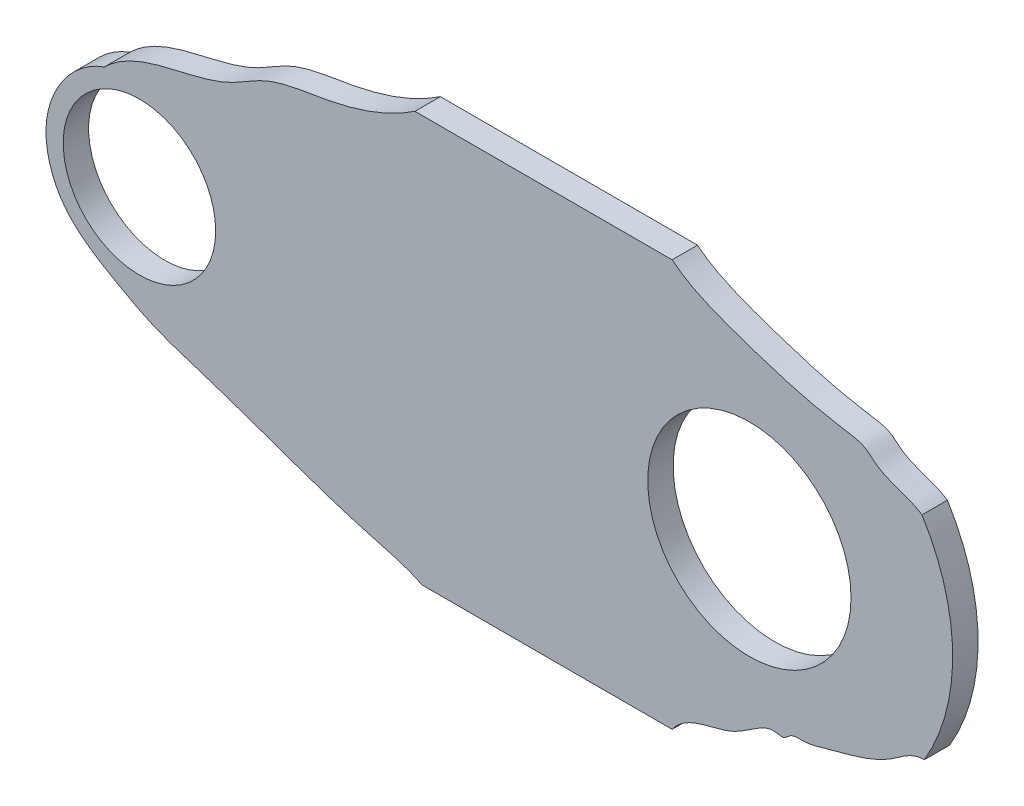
ISO-10303-21;
HEADER;
FILE_DESCRIPTION(('STEP AP214'),'2;1');
FILE_NAME('part.step','',(''),(''),'','','');
FILE_SCHEMA(('AUTOMOTIVE_DESIGN { 1 0 10303 214 1 1 1 1 }'));
ENDSEC;
DATA;
#1=APPLICATION_CONTEXT('core data for automotive mechanical design processes');
#2=APPLICATION_PROTOCOL_DEFINITION('international standard','automotive_design',2000,#1);
#3=PRODUCT_CONTEXT('',#1,'mechanical');
#4=PRODUCT('Part','Part','',(#3));
#5=PRODUCT_RELATED_PRODUCT_CATEGORY('part','',(#4));
#6=PRODUCT_DEFINITION_FORMATION('','',#4);
#7=PRODUCT_DEFINITION_CONTEXT('part definition',#1,'design');
#8=PRODUCT_DEFINITION('design','',#6,#7);
#9=PRODUCT_DEFINITION_SHAPE('','',#8);
#10=(LENGTH_UNIT() NAMED_UNIT(*) SI_UNIT(.MILLI.,.METRE.));
#11=(NAMED_UNIT(*) PLANE_ANGLE_UNIT() SI_UNIT($,.RADIAN.));
#12=(NAMED_UNIT(*) SI_UNIT($,.STERADIAN.) SOLID_ANGLE_UNIT());
#13=UNCERTAINTY_MEASURE_WITH_UNIT(LENGTH_MEASURE(1.E-05),#10,'distance_accuracy_value','');
#14=(GEOMETRIC_REPRESENTATION_CONTEXT(3) GLOBAL_UNCERTAINTY_ASSIGNED_CONTEXT((#13)) GLOBAL_UNIT_ASSIGNED_CONTEXT((#10,
#11,#12)) REPRESENTATION_CONTEXT('',''));
#15=CARTESIAN_POINT('',(0.,0.,0.));
#16=DIRECTION('',(0.,0.,1.));
#17=DIRECTION('',(1.,0.,0.));
#18=AXIS2_PLACEMENT_3D('',#15,#16,#17);
#19=CARTESIAN_POINT('',(0.,-25.4,1.5875));
#20=DIRECTION('',(0.,0.,1.));
#21=DIRECTION('',(1.,0.,0.));
#22=AXIS2_PLACEMENT_3D('',#19,#20,#21);
#23=PLANE('',#22);
#24=CARTESIAN_POINT('',(76.2,-25.4,1.5875));
#25=DIRECTION('',(0.,0.,1.));
#26=DIRECTION('',(1.,0.,0.));
#27=AXIS2_PLACEMENT_3D('',#24,#25,#26);
#28=CIRCLE('',#27,12.7);
#29=CARTESIAN_POINT('',(88.9,-25.4,1.5875));
#30=VERTEX_POINT('',#29);
#31=EDGE_CURVE('E135',#30,#30,#28,.T.);
#32=ORIENTED_EDGE('',*,*,#31,.F.);
#33=EDGE_LOOP('',(#32));
#34=FACE_BOUND('',#33,.T.);
#35=CARTESIAN_POINT('',(0.,-25.4,1.5875));
#36=DIRECTION('',(0.,0.,1.));
#37=DIRECTION('',(1.,0.,0.));
#38=AXIS2_PLACEMENT_3D('',#35,#36,#37);
#39=CIRCLE('',#38,9.525);
#40=CARTESIAN_POINT('',(9.525,-25.4,1.5875));
#41=VERTEX_POINT('',#40);
#42=EDGE_CURVE('E206',#41,#41,#39,.T.);
#43=ORIENTED_EDGE('',*,*,#42,.F.);
#44=EDGE_LOOP('',(#43));
#45=FACE_BOUND('',#44,.T.);
#46=DIRECTION('',(-1.,0.,0.));
#47=VECTOR('',#46,1.);
#48=CARTESIAN_POINT('',(0.,0.,1.5875));
#49=LINE('',#48,#47);
#50=CARTESIAN_POINT('',(66.5515188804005,0.,1.5875));
#51=VERTEX_POINT('',#50);
#52=CARTESIAN_POINT('',(34.4210052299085,0.,1.5875));
#53=VERTEX_POINT('',#52);
#54=EDGE_CURVE('E11',#51,#53,#49,.T.);
#55=ORIENTED_EDGE('',*,*,#54,.T.);
#56=CARTESIAN_POINT('',(34.4210052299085,0.,1.5875));
#57=CARTESIAN_POINT('',(31.1068154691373,-2.2380209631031,1.5875));
#58=CARTESIAN_POINT('',(24.7836750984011,-4.39158035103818,1.5875));
#59=CARTESIAN_POINT('',(16.3725521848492,-5.16756692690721,1.5875));
#60=CARTESIAN_POINT('',(8.08706240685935,-11.0508764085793,1.5875));
#61=CARTESIAN_POINT('',(-0.0218652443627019,-10.2875710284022,1.5875));
#62=CARTESIAN_POINT('',(-4.37583707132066,-14.592034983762,1.5875));
#63=B_SPLINE_CURVE_WITH_KNOTS('',3,(#56,#57,#58,#59,#60,#61,#62),.UNSPECIFIED.,.F.,.F.,(4,1,1,1,
4),(0.,0.285025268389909,0.477252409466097,0.592182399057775,1.),.UNSPECIFIED.);
#64=CARTESIAN_POINT('',(-4.37583707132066,-14.592034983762,1.5875));
#65=VERTEX_POINT('',#64);
#66=EDGE_CURVE('E69',#53,#65,#63,.T.);
#67=ORIENTED_EDGE('',*,*,#66,.T.);
#68=CARTESIAN_POINT('',(-4.37583707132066,-14.592034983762,1.5875));
#69=CARTESIAN_POINT('',(-8.48846324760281,-16.0672322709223,1.5875));
#70=CARTESIAN_POINT('',(-13.1576082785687,-22.7673859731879,1.5875));
#71=CARTESIAN_POINT('',(-10.0792392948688,-32.9254218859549,1.5875));
#72=CARTESIAN_POINT('',(-3.77750954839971,-36.6878243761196,1.5875));
#73=CARTESIAN_POINT('',(1.96612383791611,-39.8241085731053,1.5875));
#74=CARTESIAN_POINT('',(9.04935275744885,-41.9679019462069,1.5875));
#75=CARTESIAN_POINT('',(17.6035855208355,-44.997428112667,1.5875));
#76=CARTESIAN_POINT('',(26.8293725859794,-48.2818714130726,1.5875));
#77=CARTESIAN_POINT('',(32.8570605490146,-49.6067735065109,1.5875));
#78=CARTESIAN_POINT('',(35.3527860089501,-50.8,1.5875));
#79=B_SPLINE_CURVE_WITH_KNOTS('',3,(#68,#69,#70,#71,#72,#73,#74,#75,#76,#77,#78),.UNSPECIFIED.,
.F.,.F.,(4,1,1,1,1,1,1,1,4),(0.,0.186565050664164,0.294462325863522,0.418873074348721,
0.489089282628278,0.577914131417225,0.735961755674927,0.881001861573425,1.),.UNSPECIFIED.);
#80=CARTESIAN_POINT('',(35.3527860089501,-50.8,1.5875));
#81=VERTEX_POINT('',#80);
#82=EDGE_CURVE('E108',#65,#81,#79,.T.);
#83=ORIENTED_EDGE('',*,*,#82,.T.);
#84=DIRECTION('',(1.,0.,0.));
#85=VECTOR('',#84,1.);
#86=CARTESIAN_POINT('',(0.,-50.8,1.5875));
#87=LINE('',#86,#85);
#88=CARTESIAN_POINT('',(66.5515188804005,-50.8,1.5875));
#89=VERTEX_POINT('',#88);
#90=EDGE_CURVE('E120',#81,#89,#87,.T.);
#91=ORIENTED_EDGE('',*,*,#90,.T.);
#92=CARTESIAN_POINT('',(66.5515188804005,-50.8,1.5875));
#93=CARTESIAN_POINT('',(68.3851115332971,-48.2066714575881,1.5875));
#94=CARTESIAN_POINT('',(72.7990147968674,-48.4343293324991,1.5875));
#95=CARTESIAN_POINT('',(76.6520455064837,-45.6695237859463,1.5875));
#96=CARTESIAN_POINT('',(78.8215397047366,-44.3414720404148,1.5875));
#97=CARTESIAN_POINT('',(80.5474617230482,-44.9271380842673,1.5875));
#98=CARTESIAN_POINT('',(81.4612805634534,-43.7424230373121,1.5875));
#99=CARTESIAN_POINT('',(83.3052014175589,-44.0107082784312,1.5875));
#100=CARTESIAN_POINT('',(85.9904693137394,-43.1695105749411,1.5875));
#101=CARTESIAN_POINT('',(89.7402935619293,-42.2795737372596,1.5875));
#102=CARTESIAN_POINT('',(94.0483858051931,-40.5986973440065,1.5875));
#103=CARTESIAN_POINT('',(96.4612150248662,-38.3130740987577,1.5875));
#104=CARTESIAN_POINT('',(98.0566037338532,-38.3402037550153,1.5875));
#105=B_SPLINE_CURVE_WITH_KNOTS('',3,(#92,#93,#94,#95,#96,#97,#98,#99,#100,#101,#102,#103,#104),
.UNSPECIFIED.,.F.,.F.,(4,1,1,1,1,1,1,1,1,1,4),(0.,0.243553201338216,0.339654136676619,
0.417852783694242,0.450838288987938,0.478711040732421,0.531667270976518,0.597471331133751,
0.726484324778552,0.867337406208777,1.),.UNSPECIFIED.);
#106=CARTESIAN_POINT('',(98.0566037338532,-38.3402037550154,1.5875));
#107=VERTEX_POINT('',#106);
#108=EDGE_CURVE('E155',#89,#107,#105,.T.);
#109=ORIENTED_EDGE('',*,*,#108,.T.);
#110=CARTESIAN_POINT('',(76.2,-25.4,1.5875));
#111=DIRECTION('',(0.,0.,1.));
#112=DIRECTION('',(1.,0.,0.));
#113=AXIS2_PLACEMENT_3D('',#110,#111,#112);
#114=CIRCLE('',#113,25.4);
#115=CARTESIAN_POINT('',(97.7700384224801,-11.9875638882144,1.5875));
#116=VERTEX_POINT('',#115);
#117=EDGE_CURVE('E53',#107,#116,#114,.T.);
#118=ORIENTED_EDGE('',*,*,#117,.T.);
#119=CARTESIAN_POINT('',(66.5515188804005,0.,1.5875));
#120=CARTESIAN_POINT('',(68.2190463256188,-1.38420408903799,1.5875));
#121=CARTESIAN_POINT('',(71.7163860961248,-2.98038839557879,1.5875));
#122=CARTESIAN_POINT('',(77.3465555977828,-4.92336578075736,1.5875));
#123=CARTESIAN_POINT('',(82.6280367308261,-6.58165198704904,1.5875));
#124=CARTESIAN_POINT('',(87.2572940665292,-7.50686665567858,1.5875));
#125=CARTESIAN_POINT('',(90.4529661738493,-7.93062981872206,1.5875));
#126=CARTESIAN_POINT('',(93.0567702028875,-10.5140068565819,1.5875));
#127=CARTESIAN_POINT('',(95.9890772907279,-10.7827731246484,1.5875));
#128=CARTESIAN_POINT('',(97.7700384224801,-11.9875638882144,1.5875));
#129=B_SPLINE_CURVE_WITH_KNOTS('',3,(#119,#120,#121,#122,#123,#124,#125,#126,#127,#128),
.UNSPECIFIED.,.F.,.F.,(4,1,1,1,1,1,1,4),(0.,0.191374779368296,0.338945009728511,
0.531514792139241,0.680444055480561,0.76641548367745,0.804102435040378,1.),.UNSPECIFIED.);
#130=EDGE_CURVE('E165',#51,#116,#129,.T.);
#131=ORIENTED_EDGE('',*,*,#130,.F.);
#132=EDGE_LOOP('',(#55,#67,#83,#91,#109,#118,#131));
#133=FACE_BOUND('',#132,.T.);
#134=ADVANCED_FACE('F44',(#34,#45,#133),#23,.T.);
#135=CARTESIAN_POINT('',(0.,-25.4,-1.5875));
#136=DIRECTION('',(0.,0.,1.));
#137=DIRECTION('',(1.,0.,0.));
#138=AXIS2_PLACEMENT_3D('',#135,#136,#137);
#139=PLANE('',#138);
#140=CARTESIAN_POINT('',(76.2,-25.4,-1.5875));
#141=DIRECTION('',(0.,0.,1.));
#142=DIRECTION('',(1.,0.,0.));
#143=AXIS2_PLACEMENT_3D('',#140,#141,#142);
#144=CIRCLE('',#143,12.7);
#145=CARTESIAN_POINT('',(88.9,-25.4,-1.5875));
#146=VERTEX_POINT('',#145);
#147=EDGE_CURVE('E131',#146,#146,#144,.T.);
#148=ORIENTED_EDGE('',*,*,#147,.T.);
#149=EDGE_LOOP('',(#148));
#150=FACE_BOUND('',#149,.T.);
#151=CARTESIAN_POINT('',(0.,-25.4,-1.5875));
#152=DIRECTION('',(0.,0.,1.));
#153=DIRECTION('',(1.,0.,0.));
#154=AXIS2_PLACEMENT_3D('',#151,#152,#153);
#155=CIRCLE('',#154,9.525);
#156=CARTESIAN_POINT('',(9.525,-25.4,-1.5875));
#157=VERTEX_POINT('',#156);
#158=EDGE_CURVE('E212',#157,#157,#155,.T.);
#159=ORIENTED_EDGE('',*,*,#158,.T.);
#160=EDGE_LOOP('',(#159));
#161=FACE_BOUND('',#160,.T.);
#162=CARTESIAN_POINT('',(34.4210052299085,0.,-1.5875));
#163=CARTESIAN_POINT('',(31.1068154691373,-2.2380209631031,-1.5875));
#164=CARTESIAN_POINT('',(24.7836750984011,-4.39158035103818,-1.5875));
#165=CARTESIAN_POINT('',(16.3725521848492,-5.16756692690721,-1.5875));
#166=CARTESIAN_POINT('',(8.08706240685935,-11.0508764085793,-1.5875));
#167=CARTESIAN_POINT('',(-0.0218652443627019,-10.2875710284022,-1.5875));
#168=CARTESIAN_POINT('',(-4.37583707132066,-14.592034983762,-1.5875));
#169=B_SPLINE_CURVE_WITH_KNOTS('',3,(#162,#163,#164,#165,#166,#167,#168),.UNSPECIFIED.,.F.,.F.,
(4,1,1,1,4),(0.,0.285025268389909,0.477252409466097,0.592182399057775,1.),.UNSPECIFIED.);
#170=CARTESIAN_POINT('',(-4.37583707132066,-14.592034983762,-1.5875));
#171=VERTEX_POINT('',#170);
#172=CARTESIAN_POINT('',(34.4210052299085,0.,-1.5875));
#173=VERTEX_POINT('',#172);
#174=EDGE_CURVE('E121',#171,#173,#169,.F.);
#175=ORIENTED_EDGE('',*,*,#174,.T.);
#176=DIRECTION('',(-1.,0.,0.));
#177=VECTOR('',#176,1.);
#178=CARTESIAN_POINT('',(0.,0.,-1.5875));
#179=LINE('',#178,#177);
#180=CARTESIAN_POINT('',(66.5515188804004,0.,-1.5875));
#181=VERTEX_POINT('',#180);
#182=EDGE_CURVE('E48',#181,#173,#179,.T.);
#183=ORIENTED_EDGE('',*,*,#182,.F.);
#184=CARTESIAN_POINT('',(66.5515188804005,0.,-1.5875));
#185=CARTESIAN_POINT('',(68.2190463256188,-1.38420408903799,-1.5875));
#186=CARTESIAN_POINT('',(71.7163860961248,-2.98038839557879,-1.5875));
#187=CARTESIAN_POINT('',(77.3465555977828,-4.92336578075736,-1.5875));
#188=CARTESIAN_POINT('',(82.6280367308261,-6.58165198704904,-1.5875));
#189=CARTESIAN_POINT('',(87.2572940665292,-7.50686665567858,-1.5875));
#190=CARTESIAN_POINT('',(90.4529661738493,-7.93062981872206,-1.5875));
#191=CARTESIAN_POINT('',(93.0567702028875,-10.5140068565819,-1.5875));
#192=CARTESIAN_POINT('',(95.9890772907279,-10.7827731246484,-1.5875));
#193=CARTESIAN_POINT('',(97.7700384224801,-11.9875638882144,-1.5875));
#194=B_SPLINE_CURVE_WITH_KNOTS('',3,(#184,#185,#186,#187,#188,#189,#190,#191,#192,#193),
.UNSPECIFIED.,.F.,.F.,(4,1,1,1,1,1,1,4),(0.,0.191374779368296,0.338945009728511,
0.531514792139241,0.680444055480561,0.76641548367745,0.804102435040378,1.),.UNSPECIFIED.);
#195=CARTESIAN_POINT('',(97.7700384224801,-11.9875638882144,-1.5875));
#196=VERTEX_POINT('',#195);
#197=EDGE_CURVE('E149',#196,#181,#194,.F.);
#198=ORIENTED_EDGE('',*,*,#197,.F.);
#199=CARTESIAN_POINT('',(76.2,-25.4,-1.5875));
#200=DIRECTION('',(0.,0.,1.));
#201=DIRECTION('',(1.,0.,0.));
#202=AXIS2_PLACEMENT_3D('',#199,#200,#201);
#203=CIRCLE('',#202,25.4);
#204=CARTESIAN_POINT('',(98.0566037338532,-38.3402037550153,-1.5875));
#205=VERTEX_POINT('',#204);
#206=EDGE_CURVE('E129',#205,#196,#203,.T.);
#207=ORIENTED_EDGE('',*,*,#206,.F.);
#208=CARTESIAN_POINT('',(66.5515188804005,-50.8,-1.5875));
#209=CARTESIAN_POINT('',(68.3851115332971,-48.2066714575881,-1.5875));
#210=CARTESIAN_POINT('',(72.7990147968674,-48.4343293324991,-1.5875));
#211=CARTESIAN_POINT('',(76.6520455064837,-45.6695237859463,-1.5875));
#212=CARTESIAN_POINT('',(78.8215397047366,-44.3414720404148,-1.5875));
#213=CARTESIAN_POINT('',(80.5474617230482,-44.9271380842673,-1.5875));
#214=CARTESIAN_POINT('',(81.4612805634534,-43.7424230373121,-1.5875));
#215=CARTESIAN_POINT('',(83.3052014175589,-44.0107082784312,-1.5875));
#216=CARTESIAN_POINT('',(85.9904693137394,-43.1695105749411,-1.5875));
#217=CARTESIAN_POINT('',(89.7402935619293,-42.2795737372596,-1.5875));
#218=CARTESIAN_POINT('',(94.0483858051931,-40.5986973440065,-1.5875));
#219=CARTESIAN_POINT('',(96.4612150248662,-38.3130740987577,-1.5875));
#220=CARTESIAN_POINT('',(98.0566037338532,-38.3402037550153,-1.5875));
#221=B_SPLINE_CURVE_WITH_KNOTS('',3,(#208,#209,#210,#211,#212,#213,#214,#215,#216,#217,#218,
#219,#220),.UNSPECIFIED.,.F.,.F.,(4,1,1,1,1,1,1,1,1,1,4),(0.,0.243553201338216,
0.339654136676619,0.417852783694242,0.450838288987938,0.478711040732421,0.531667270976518,
0.597471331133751,0.726484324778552,0.867337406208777,1.),.UNSPECIFIED.);
#222=CARTESIAN_POINT('',(66.5515188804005,-50.8,-1.5875));
#223=VERTEX_POINT('',#222);
#224=EDGE_CURVE('E61',#205,#223,#221,.F.);
#225=ORIENTED_EDGE('',*,*,#224,.T.);
#226=DIRECTION('',(1.,0.,0.));
#227=VECTOR('',#226,1.);
#228=CARTESIAN_POINT('',(0.,-50.8,-1.5875));
#229=LINE('',#228,#227);
#230=CARTESIAN_POINT('',(35.3527860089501,-50.8,-1.5875));
#231=VERTEX_POINT('',#230);
#232=EDGE_CURVE('E134',#231,#223,#229,.T.);
#233=ORIENTED_EDGE('',*,*,#232,.F.);
#234=CARTESIAN_POINT('',(-4.37583707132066,-14.592034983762,-1.5875));
#235=CARTESIAN_POINT('',(-8.48846324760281,-16.0672322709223,-1.5875));
#236=CARTESIAN_POINT('',(-13.1576082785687,-22.7673859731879,-1.5875));
#237=CARTESIAN_POINT('',(-10.0792392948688,-32.9254218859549,-1.5875));
#238=CARTESIAN_POINT('',(-3.77750954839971,-36.6878243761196,-1.5875));
#239=CARTESIAN_POINT('',(1.96612383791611,-39.8241085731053,-1.5875));
#240=CARTESIAN_POINT('',(9.04935275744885,-41.9679019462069,-1.5875));
#241=CARTESIAN_POINT('',(17.6035855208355,-44.997428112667,-1.5875));
#242=CARTESIAN_POINT('',(26.8293725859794,-48.2818714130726,-1.5875));
#243=CARTESIAN_POINT('',(32.8570605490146,-49.6067735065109,-1.5875));
#244=CARTESIAN_POINT('',(35.3527860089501,-50.8,-1.5875));
#245=B_SPLINE_CURVE_WITH_KNOTS('',3,(#234,#235,#236,#237,#238,#239,#240,#241,#242,#243,#244),
.UNSPECIFIED.,.F.,.F.,(4,1,1,1,1,1,1,1,4),(0.,0.186565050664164,0.294462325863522,
0.418873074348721,0.489089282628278,0.577914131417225,0.735961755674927,0.881001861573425,1.),.UNSPECIFIED.);
#246=EDGE_CURVE('E110',#231,#171,#245,.F.);
#247=ORIENTED_EDGE('',*,*,#246,.T.);
#248=EDGE_LOOP('',(#175,#183,#198,#207,#225,#233,#247));
#249=FACE_BOUND('',#248,.T.);
#250=ADVANCED_FACE('F147',(#150,#161,#249),#139,.F.);
#251=CARTESIAN_POINT('',(0.,-50.8,1.5875));
#252=DIRECTION('',(0.,1.,0.));
#253=DIRECTION('',(0.,0.,1.));
#254=AXIS2_PLACEMENT_3D('',#251,#252,#253);
#255=PLANE('',#254);
#256=DIRECTION('',(0.,0.,1.));
#257=VECTOR('',#256,1.);
#258=CARTESIAN_POINT('',(35.3527860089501,-50.8,-1.5885));
#259=LINE('',#258,#257);
#260=EDGE_CURVE('E105',#231,#81,#259,.T.);
#261=ORIENTED_EDGE('',*,*,#260,.F.);
#262=ORIENTED_EDGE('',*,*,#232,.T.);
#263=DIRECTION('',(0.,0.,1.));
#264=VECTOR('',#263,1.);
#265=CARTESIAN_POINT('',(66.5515188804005,-50.8,-1.5885));
#266=LINE('',#265,#264);
#267=EDGE_CURVE('E124',#223,#89,#266,.T.);
#268=ORIENTED_EDGE('',*,*,#267,.T.);
#269=ORIENTED_EDGE('',*,*,#90,.F.);
#270=EDGE_LOOP('',(#261,#262,#268,#269));
#271=FACE_BOUND('',#270,.T.);
#272=ADVANCED_FACE('F46',(#271),#255,.F.);
#273=CARTESIAN_POINT('',(76.2,-25.4,1.5875));
#274=DIRECTION('',(0.,0.,-1.));
#275=DIRECTION('',(-1.,0.,0.));
#276=AXIS2_PLACEMENT_3D('',#273,#274,#275);
#277=CYLINDRICAL_SURFACE('',#276,25.4);
#278=ORIENTED_EDGE('',*,*,#206,.T.);
#279=DIRECTION('',(0.,0.,1.));
#280=VECTOR('',#279,1.);
#281=CARTESIAN_POINT('',(97.7700384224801,-11.9875638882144,-1.5885));
#282=LINE('',#281,#280);
#283=EDGE_CURVE('E142',#196,#116,#282,.T.);
#284=ORIENTED_EDGE('',*,*,#283,.T.);
#285=ORIENTED_EDGE('',*,*,#117,.F.);
#286=DIRECTION('',(0.,0.,1.));
#287=VECTOR('',#286,1.);
#288=CARTESIAN_POINT('',(98.0566037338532,-38.3402037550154,-1.5885));
#289=LINE('',#288,#287);
#290=EDGE_CURVE('E143',#205,#107,#289,.T.);
#291=ORIENTED_EDGE('',*,*,#290,.F.);
#292=EDGE_LOOP('',(#278,#284,#285,#291));
#293=FACE_BOUND('',#292,.T.);
#294=ADVANCED_FACE('F140',(#293),#277,.T.);
#295=CARTESIAN_POINT('',(0.,0.,1.5875));
#296=DIRECTION('',(0.,-1.,0.));
#297=DIRECTION('',(0.,0.,-1.));
#298=AXIS2_PLACEMENT_3D('',#295,#296,#297);
#299=PLANE('',#298);
#300=DIRECTION('',(0.,0.,1.));
#301=VECTOR('',#300,1.);
#302=CARTESIAN_POINT('',(34.4210052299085,0.,-1.5885));
#303=LINE('',#302,#301);
#304=EDGE_CURVE('E214',#173,#53,#303,.T.);
#305=ORIENTED_EDGE('',*,*,#304,.T.);
#306=ORIENTED_EDGE('',*,*,#54,.F.);
#307=DIRECTION('',(0.,0.,1.));
#308=VECTOR('',#307,1.);
#309=CARTESIAN_POINT('',(66.5515188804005,0.,-1.5885));
#310=LINE('',#309,#308);
#311=EDGE_CURVE('E153',#181,#51,#310,.T.);
#312=ORIENTED_EDGE('',*,*,#311,.F.);
#313=ORIENTED_EDGE('',*,*,#182,.T.);
#314=EDGE_LOOP('',(#305,#306,#312,#313));
#315=FACE_BOUND('',#314,.T.);
#316=ADVANCED_FACE('F225',(#315),#299,.F.);
#317=CARTESIAN_POINT('',(76.2,-25.4,1.5875));
#318=DIRECTION('',(0.,0.,-1.));
#319=DIRECTION('',(-1.,0.,0.));
#320=AXIS2_PLACEMENT_3D('',#317,#318,#319);
#321=CYLINDRICAL_SURFACE('',#320,12.7);
#322=ORIENTED_EDGE('',*,*,#31,.T.);
#323=EDGE_LOOP('',(#322));
#324=FACE_BOUND('',#323,.T.);
#325=ORIENTED_EDGE('',*,*,#147,.F.);
#326=EDGE_LOOP('',(#325));
#327=FACE_BOUND('',#326,.T.);
#328=ADVANCED_FACE('F223',(#324,#327),#321,.F.);
#329=CARTESIAN_POINT('',(0.,-25.4,1.5875));
#330=DIRECTION('',(0.,0.,-1.));
#331=DIRECTION('',(-1.,0.,0.));
#332=AXIS2_PLACEMENT_3D('',#329,#330,#331);
#333=CYLINDRICAL_SURFACE('',#332,9.525);
#334=ORIENTED_EDGE('',*,*,#42,.T.);
#335=EDGE_LOOP('',(#334));
#336=FACE_BOUND('',#335,.T.);
#337=ORIENTED_EDGE('',*,*,#158,.F.);
#338=EDGE_LOOP('',(#337));
#339=FACE_BOUND('',#338,.T.);
#340=ADVANCED_FACE('F186',(#336,#339),#333,.F.);
#341=CARTESIAN_POINT('',(66.5515188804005,0.,-1.5885));
#342=CARTESIAN_POINT('',(68.2190463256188,-1.38420408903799,-1.5885));
#343=CARTESIAN_POINT('',(71.7163860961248,-2.98038839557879,-1.5885));
#344=CARTESIAN_POINT('',(77.3465555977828,-4.92336578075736,-1.5885));
#345=CARTESIAN_POINT('',(82.6280367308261,-6.58165198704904,-1.5885));
#346=CARTESIAN_POINT('',(87.2572940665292,-7.50686665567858,-1.5885));
#347=CARTESIAN_POINT('',(90.4529661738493,-7.93062981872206,-1.5885));
#348=CARTESIAN_POINT('',(93.0567702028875,-10.5140068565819,-1.5885));
#349=CARTESIAN_POINT('',(95.9890772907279,-10.7827731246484,-1.5885));
#350=CARTESIAN_POINT('',(97.7700384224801,-11.9875638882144,-1.5885));
#351=B_SPLINE_CURVE_WITH_KNOTS('',3,(#341,#342,#343,#344,#345,#346,#347,#348,#349,#350),
.UNSPECIFIED.,.F.,.F.,(4,1,1,1,1,1,1,4),(0.,0.191374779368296,0.338945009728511,
0.531514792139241,0.680444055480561,0.76641548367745,0.804102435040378,1.),.UNSPECIFIED.);
#352=DIRECTION('',(0.,0.,1.));
#353=VECTOR('',#352,1.);
#354=SURFACE_OF_LINEAR_EXTRUSION('',#351,#353);
#355=ORIENTED_EDGE('',*,*,#197,.T.);
#356=ORIENTED_EDGE('',*,*,#311,.T.);
#357=ORIENTED_EDGE('',*,*,#130,.T.);
#358=ORIENTED_EDGE('',*,*,#283,.F.);
#359=EDGE_LOOP('',(#355,#356,#357,#358));
#360=FACE_BOUND('',#359,.T.);
#361=ADVANCED_FACE('F181',(#360),#354,.F.);
#362=CARTESIAN_POINT('',(34.4210052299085,0.,-1.5885));
#363=CARTESIAN_POINT('',(31.1068154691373,-2.2380209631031,-1.5885));
#364=CARTESIAN_POINT('',(24.7836750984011,-4.39158035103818,-1.5885));
#365=CARTESIAN_POINT('',(16.3725521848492,-5.16756692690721,-1.5885));
#366=CARTESIAN_POINT('',(8.08706240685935,-11.0508764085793,-1.5885));
#367=CARTESIAN_POINT('',(-0.0218652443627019,-10.2875710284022,-1.5885));
#368=CARTESIAN_POINT('',(-4.37583707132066,-14.592034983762,-1.5885));
#369=B_SPLINE_CURVE_WITH_KNOTS('',3,(#362,#363,#364,#365,#366,#367,#368),.UNSPECIFIED.,.F.,.F.,
(4,1,1,1,4),(0.,0.285025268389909,0.477252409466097,0.592182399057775,1.),.UNSPECIFIED.);
#370=DIRECTION('',(0.,0.,1.));
#371=VECTOR('',#370,1.);
#372=SURFACE_OF_LINEAR_EXTRUSION('',#369,#371);
#373=DIRECTION('',(0.,0.,1.));
#374=VECTOR('',#373,1.);
#375=CARTESIAN_POINT('',(-4.37583707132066,-14.592034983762,-1.5885));
#376=LINE('',#375,#374);
#377=EDGE_CURVE('E115',#171,#65,#376,.T.);
#378=ORIENTED_EDGE('',*,*,#377,.T.);
#379=ORIENTED_EDGE('',*,*,#66,.F.);
#380=ORIENTED_EDGE('',*,*,#304,.F.);
#381=ORIENTED_EDGE('',*,*,#174,.F.);
#382=EDGE_LOOP('',(#378,#379,#380,#381));
#383=FACE_BOUND('',#382,.T.);
#384=ADVANCED_FACE('F185',(#383),#372,.T.);
#385=CARTESIAN_POINT('',(-4.37583707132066,-14.592034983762,-1.5885));
#386=CARTESIAN_POINT('',(-8.48846324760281,-16.0672322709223,-1.5885));
#387=CARTESIAN_POINT('',(-13.1576082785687,-22.7673859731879,-1.5885));
#388=CARTESIAN_POINT('',(-10.0792392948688,-32.9254218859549,-1.5885));
#389=CARTESIAN_POINT('',(-3.77750954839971,-36.6878243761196,-1.5885));
#390=CARTESIAN_POINT('',(1.96612383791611,-39.8241085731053,-1.5885));
#391=CARTESIAN_POINT('',(9.04935275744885,-41.9679019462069,-1.5885));
#392=CARTESIAN_POINT('',(17.6035855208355,-44.997428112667,-1.5885));
#393=CARTESIAN_POINT('',(26.8293725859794,-48.2818714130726,-1.5885));
#394=CARTESIAN_POINT('',(32.8570605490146,-49.6067735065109,-1.5885));
#395=CARTESIAN_POINT('',(35.3527860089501,-50.8,-1.5885));
#396=B_SPLINE_CURVE_WITH_KNOTS('',3,(#385,#386,#387,#388,#389,#390,#391,#392,#393,#394,#395),
.UNSPECIFIED.,.F.,.F.,(4,1,1,1,1,1,1,1,4),(0.,0.186565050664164,0.294462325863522,
0.418873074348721,0.489089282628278,0.577914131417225,0.735961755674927,0.881001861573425,1.),.UNSPECIFIED.);
#397=DIRECTION('',(0.,0.,1.));
#398=VECTOR('',#397,1.);
#399=SURFACE_OF_LINEAR_EXTRUSION('',#396,#398);
#400=ORIENTED_EDGE('',*,*,#260,.T.);
#401=ORIENTED_EDGE('',*,*,#82,.F.);
#402=ORIENTED_EDGE('',*,*,#377,.F.);
#403=ORIENTED_EDGE('',*,*,#246,.F.);
#404=EDGE_LOOP('',(#400,#401,#402,#403));
#405=FACE_BOUND('',#404,.T.);
#406=ADVANCED_FACE('F107',(#405),#399,.T.);
#407=CARTESIAN_POINT('',(66.5515188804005,-50.8,-1.5885));
#408=CARTESIAN_POINT('',(68.3851115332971,-48.2066714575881,-1.5885));
#409=CARTESIAN_POINT('',(72.7990147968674,-48.4343293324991,-1.5885));
#410=CARTESIAN_POINT('',(76.6520455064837,-45.6695237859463,-1.5885));
#411=CARTESIAN_POINT('',(78.8215397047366,-44.3414720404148,-1.5885));
#412=CARTESIAN_POINT('',(80.5474617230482,-44.9271380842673,-1.5885));
#413=CARTESIAN_POINT('',(81.4612805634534,-43.7424230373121,-1.5885));
#414=CARTESIAN_POINT('',(83.3052014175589,-44.0107082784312,-1.5885));
#415=CARTESIAN_POINT('',(85.9904693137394,-43.1695105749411,-1.5885));
#416=CARTESIAN_POINT('',(89.7402935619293,-42.2795737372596,-1.5885));
#417=CARTESIAN_POINT('',(94.0483858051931,-40.5986973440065,-1.5885));
#418=CARTESIAN_POINT('',(96.4612150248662,-38.3130740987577,-1.5885));
#419=CARTESIAN_POINT('',(98.0566037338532,-38.3402037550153,-1.5885));
#420=B_SPLINE_CURVE_WITH_KNOTS('',3,(#407,#408,#409,#410,#411,#412,#413,#414,#415,#416,#417,
#418,#419),.UNSPECIFIED.,.F.,.F.,(4,1,1,1,1,1,1,1,1,1,4),(0.,0.243553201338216,
0.339654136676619,0.417852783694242,0.450838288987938,0.478711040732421,0.531667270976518,
0.597471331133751,0.726484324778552,0.867337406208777,1.),.UNSPECIFIED.);
#421=DIRECTION('',(0.,0.,1.));
#422=VECTOR('',#421,1.);
#423=SURFACE_OF_LINEAR_EXTRUSION('',#420,#422);
#424=ORIENTED_EDGE('',*,*,#290,.T.);
#425=ORIENTED_EDGE('',*,*,#108,.F.);
#426=ORIENTED_EDGE('',*,*,#267,.F.);
#427=ORIENTED_EDGE('',*,*,#224,.F.);
#428=EDGE_LOOP('',(#424,#425,#426,#427));
#429=FACE_BOUND('',#428,.T.);
#430=ADVANCED_FACE('F189',(#429),#423,.T.);
#431=CLOSED_SHELL('',(#134,#250,#272,#294,#316,#328,#340,#361,#384,#406,#430));
#432=MANIFOLD_SOLID_BREP('B2',#431);
#433=ADVANCED_BREP_SHAPE_REPRESENTATION('',(#18,#432),#14);
#434=SHAPE_DEFINITION_REPRESENTATION(#9,#433);
ENDSEC;
END-ISO-10303-21;
